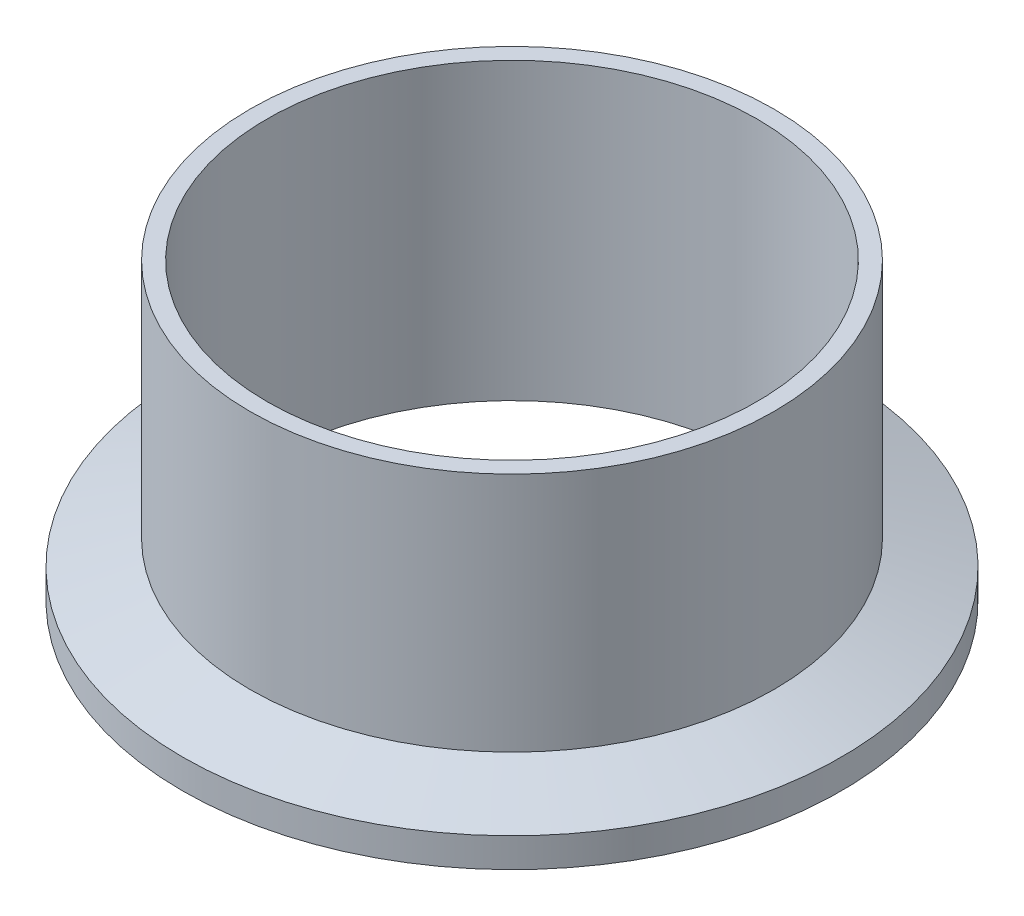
ISO-10303-21;
HEADER;
FILE_DESCRIPTION(('STEP AP214'),'2;1');
FILE_NAME('part.step','',(''),(''),'','','');
FILE_SCHEMA(('AUTOMOTIVE_DESIGN { 1 0 10303 214 1 1 1 1 }'));
ENDSEC;
DATA;
#1=APPLICATION_CONTEXT('core data for automotive mechanical design processes');
#2=APPLICATION_PROTOCOL_DEFINITION('international standard','automotive_design',2000,#1);
#3=PRODUCT_CONTEXT('',#1,'mechanical');
#4=PRODUCT('Part','Part','',(#3));
#5=PRODUCT_RELATED_PRODUCT_CATEGORY('part','',(#4));
#6=PRODUCT_DEFINITION_FORMATION('','',#4);
#7=PRODUCT_DEFINITION_CONTEXT('part definition',#1,'design');
#8=PRODUCT_DEFINITION('design','',#6,#7);
#9=PRODUCT_DEFINITION_SHAPE('','',#8);
#10=(LENGTH_UNIT() NAMED_UNIT(*) SI_UNIT(.MILLI.,.METRE.));
#11=(NAMED_UNIT(*) PLANE_ANGLE_UNIT() SI_UNIT($,.RADIAN.));
#12=(NAMED_UNIT(*) SI_UNIT($,.STERADIAN.) SOLID_ANGLE_UNIT());
#13=UNCERTAINTY_MEASURE_WITH_UNIT(LENGTH_MEASURE(1.E-05),#10,'distance_accuracy_value','');
#14=(GEOMETRIC_REPRESENTATION_CONTEXT(3) GLOBAL_UNCERTAINTY_ASSIGNED_CONTEXT((#13)) GLOBAL_UNIT_ASSIGNED_CONTEXT((#10,
#11,#12)) REPRESENTATION_CONTEXT('',''));
#15=CARTESIAN_POINT('',(0.,0.,0.));
#16=DIRECTION('',(0.,0.,1.));
#17=DIRECTION('',(1.,0.,0.));
#18=AXIS2_PLACEMENT_3D('',#15,#16,#17);
#19=CARTESIAN_POINT('',(0.,0.787399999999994,0.));
#20=DIRECTION('',(0.,-1.,0.));
#21=DIRECTION('',(0.,0.,-1.));
#22=AXIS2_PLACEMENT_3D('',#19,#20,#21);
#23=TOROIDAL_SURFACE('',#22,29.9866084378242,0.787399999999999);
#24=CARTESIAN_POINT('',(0.,0.,0.));
#25=DIRECTION('',(0.,-1.,0.));
#26=DIRECTION('',(0.,0.,-1.));
#27=AXIS2_PLACEMENT_3D('',#24,#25,#26);
#28=CIRCLE('',#27,29.9866084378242);
#29=CARTESIAN_POINT('',(0.,0.,-29.9866084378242));
#30=VERTEX_POINT('',#29);
#31=EDGE_CURVE('E64',#30,#30,#28,.T.);
#32=ORIENTED_EDGE('',*,*,#31,.T.);
#33=EDGE_LOOP('',(#32));
#34=FACE_BOUND('',#33,.T.);
#35=CARTESIAN_POINT('',(0.,0.474458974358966,0.));
#36=DIRECTION('',(0.,-1.,0.));
#37=DIRECTION('',(0.,0.,-1.));
#38=AXIS2_PLACEMENT_3D('',#35,#36,#37);
#39=CIRCLE('',#38,29.2640666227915);
#40=CARTESIAN_POINT('',(0.,0.474458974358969,-29.2640666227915));
#41=VERTEX_POINT('',#40);
#42=EDGE_CURVE('E10',#41,#41,#39,.T.);
#43=ORIENTED_EDGE('',*,*,#42,.F.);
#44=EDGE_LOOP('',(#43));
#45=FACE_BOUND('',#44,.T.);
#46=ADVANCED_FACE('F30',(#34,#45),#23,.T.);
#47=CARTESIAN_POINT('',(0.,0.,0.));
#48=DIRECTION('',(0.,-1.,0.));
#49=DIRECTION('',(0.,0.,-1.));
#50=AXIS2_PLACEMENT_3D('',#47,#48,#49);
#51=TOROIDAL_SURFACE('',#50,28.1686,1.1938);
#52=CARTESIAN_POINT('',(0.,0.474458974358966,0.));
#53=DIRECTION('',(0.,-1.,0.));
#54=DIRECTION('',(0.,0.,-1.));
#55=AXIS2_PLACEMENT_3D('',#52,#53,#54);
#56=CIRCLE('',#55,27.0731333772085);
#57=CARTESIAN_POINT('',(0.,0.474458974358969,-27.0731333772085));
#58=VERTEX_POINT('',#57);
#59=EDGE_CURVE('E36',#58,#58,#56,.T.);
#60=ORIENTED_EDGE('',*,*,#59,.F.);
#61=EDGE_LOOP('',(#60));
#62=FACE_BOUND('',#61,.T.);
#63=ORIENTED_EDGE('',*,*,#42,.T.);
#64=EDGE_LOOP('',(#63));
#65=FACE_BOUND('',#64,.T.);
#66=ADVANCED_FACE('F112',(#62,#65),#51,.F.);
#67=CARTESIAN_POINT('',(0.,0.787399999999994,0.));
#68=DIRECTION('',(0.,-1.,0.));
#69=DIRECTION('',(0.,0.,-1.));
#70=AXIS2_PLACEMENT_3D('',#67,#68,#69);
#71=TOROIDAL_SURFACE('',#70,26.3505915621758,0.787399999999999);
#72=ORIENTED_EDGE('',*,*,#59,.T.);
#73=EDGE_LOOP('',(#72));
#74=FACE_BOUND('',#73,.T.);
#75=CARTESIAN_POINT('',(0.,0.,0.));
#76=DIRECTION('',(0.,-1.,0.));
#77=DIRECTION('',(0.,0.,-1.));
#78=AXIS2_PLACEMENT_3D('',#75,#76,#77);
#79=CIRCLE('',#78,26.3505915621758);
#80=CARTESIAN_POINT('',(0.,0.,-26.3505915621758));
#81=VERTEX_POINT('',#80);
#82=EDGE_CURVE('E40',#81,#81,#79,.T.);
#83=ORIENTED_EDGE('',*,*,#82,.F.);
#84=EDGE_LOOP('',(#83));
#85=FACE_BOUND('',#84,.T.);
#86=ADVANCED_FACE('F108',(#74,#85),#71,.T.);
#87=CARTESIAN_POINT('',(0.,0.,0.));
#88=DIRECTION('',(0.,1.,0.));
#89=DIRECTION('',(0.,0.,1.));
#90=AXIS2_PLACEMENT_3D('',#87,#88,#89);
#91=PLANE('',#90);
#92=CARTESIAN_POINT('',(0.,0.,0.));
#93=DIRECTION('',(0.,-1.,0.));
#94=DIRECTION('',(0.,0.,-1.));
#95=AXIS2_PLACEMENT_3D('',#92,#93,#94);
#96=CIRCLE('',#95,23.749);
#97=CARTESIAN_POINT('',(0.,0.,-23.749));
#98=VERTEX_POINT('',#97);
#99=EDGE_CURVE('E44',#98,#98,#96,.T.);
#100=ORIENTED_EDGE('',*,*,#99,.F.);
#101=EDGE_LOOP('',(#100));
#102=FACE_BOUND('',#101,.T.);
#103=ORIENTED_EDGE('',*,*,#82,.T.);
#104=EDGE_LOOP('',(#103));
#105=FACE_BOUND('',#104,.T.);
#106=ADVANCED_FACE('F102',(#102,#105),#91,.F.);
#107=CARTESIAN_POINT('',(0.,0.,0.));
#108=DIRECTION('',(0.,-1.,0.));
#109=DIRECTION('',(0.,0.,-1.));
#110=AXIS2_PLACEMENT_3D('',#107,#108,#109);
#111=CYLINDRICAL_SURFACE('',#110,23.749);
#112=ORIENTED_EDGE('',*,*,#99,.T.);
#113=EDGE_LOOP('',(#112));
#114=FACE_BOUND('',#113,.T.);
#115=CARTESIAN_POINT('',(0.,28.575,0.));
#116=DIRECTION('',(0.,-1.,0.));
#117=DIRECTION('',(0.,0.,-1.));
#118=AXIS2_PLACEMENT_3D('',#115,#116,#117);
#119=CIRCLE('',#118,23.749);
#120=CARTESIAN_POINT('',(0.,28.575,-23.749));
#121=VERTEX_POINT('',#120);
#122=EDGE_CURVE('E49',#121,#121,#119,.T.);
#123=ORIENTED_EDGE('',*,*,#122,.F.);
#124=EDGE_LOOP('',(#123));
#125=FACE_BOUND('',#124,.T.);
#126=ADVANCED_FACE('F97',(#114,#125),#111,.F.);
#127=CARTESIAN_POINT('',(0.,28.575,0.));
#128=DIRECTION('',(0.,-1.,0.));
#129=DIRECTION('',(0.,0.,-1.));
#130=AXIS2_PLACEMENT_3D('',#127,#128,#129);
#131=PLANE('',#130);
#132=CARTESIAN_POINT('',(0.,28.575,0.));
#133=DIRECTION('',(0.,-1.,0.));
#134=DIRECTION('',(0.,0.,-1.));
#135=AXIS2_PLACEMENT_3D('',#132,#133,#134);
#136=CIRCLE('',#135,25.4);
#137=CARTESIAN_POINT('',(0.,28.575,-25.4));
#138=VERTEX_POINT('',#137);
#139=EDGE_CURVE('E52',#138,#138,#136,.T.);
#140=ORIENTED_EDGE('',*,*,#139,.F.);
#141=EDGE_LOOP('',(#140));
#142=FACE_BOUND('',#141,.T.);
#143=ORIENTED_EDGE('',*,*,#122,.T.);
#144=EDGE_LOOP('',(#143));
#145=FACE_BOUND('',#144,.T.);
#146=ADVANCED_FACE('F91',(#142,#145),#131,.F.);
#147=CARTESIAN_POINT('',(0.,0.,0.));
#148=DIRECTION('',(0.,-1.,0.));
#149=DIRECTION('',(0.,0.,-1.));
#150=AXIS2_PLACEMENT_3D('',#147,#148,#149);
#151=CYLINDRICAL_SURFACE('',#150,25.4);
#152=CARTESIAN_POINT('',(0.,5.22996973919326,0.));
#153=DIRECTION('',(0.,-1.,0.));
#154=DIRECTION('',(0.,0.,-1.));
#155=AXIS2_PLACEMENT_3D('',#152,#153,#154);
#156=CIRCLE('',#155,25.4);
#157=CARTESIAN_POINT('',(0.,5.22996973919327,-25.4));
#158=VERTEX_POINT('',#157);
#159=EDGE_CURVE('E55',#158,#158,#156,.T.);
#160=ORIENTED_EDGE('',*,*,#159,.F.);
#161=EDGE_LOOP('',(#160));
#162=FACE_BOUND('',#161,.T.);
#163=ORIENTED_EDGE('',*,*,#139,.T.);
#164=EDGE_LOOP('',(#163));
#165=FACE_BOUND('',#164,.T.);
#166=ADVANCED_FACE('F85',(#162,#165),#151,.T.);
#167=CARTESIAN_POINT('',(0.,5.22996973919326,0.));
#168=DIRECTION('',(0.,-1.,0.));
#169=DIRECTION('',(0.,0.,-1.));
#170=AXIS2_PLACEMENT_3D('',#167,#168,#169);
#171=CONICAL_SURFACE('',#170,25.4,1.22173047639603);
#172=CARTESIAN_POINT('',(0.,2.84480000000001,0.));
#173=DIRECTION('',(0.,-1.,0.));
#174=DIRECTION('',(0.,0.,-1.));
#175=AXIS2_PLACEMENT_3D('',#172,#173,#174);
#176=CIRCLE('',#175,31.9532);
#177=CARTESIAN_POINT('',(0.,2.84480000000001,-31.9532));
#178=VERTEX_POINT('',#177);
#179=EDGE_CURVE('E58',#178,#178,#176,.T.);
#180=ORIENTED_EDGE('',*,*,#179,.F.);
#181=EDGE_LOOP('',(#180));
#182=FACE_BOUND('',#181,.T.);
#183=ORIENTED_EDGE('',*,*,#159,.T.);
#184=EDGE_LOOP('',(#183));
#185=FACE_BOUND('',#184,.T.);
#186=ADVANCED_FACE('F79',(#182,#185),#171,.T.);
#187=CARTESIAN_POINT('',(0.,0.,0.));
#188=DIRECTION('',(0.,-1.,0.));
#189=DIRECTION('',(0.,0.,-1.));
#190=AXIS2_PLACEMENT_3D('',#187,#188,#189);
#191=CYLINDRICAL_SURFACE('',#190,31.9532);
#192=CARTESIAN_POINT('',(0.,0.,0.));
#193=DIRECTION('',(0.,-1.,0.));
#194=DIRECTION('',(0.,0.,-1.));
#195=AXIS2_PLACEMENT_3D('',#192,#193,#194);
#196=CIRCLE('',#195,31.9532);
#197=CARTESIAN_POINT('',(0.,0.,-31.9532));
#198=VERTEX_POINT('',#197);
#199=EDGE_CURVE('E61',#198,#198,#196,.T.);
#200=ORIENTED_EDGE('',*,*,#199,.F.);
#201=EDGE_LOOP('',(#200));
#202=FACE_BOUND('',#201,.T.);
#203=ORIENTED_EDGE('',*,*,#179,.T.);
#204=EDGE_LOOP('',(#203));
#205=FACE_BOUND('',#204,.T.);
#206=ADVANCED_FACE('F73',(#202,#205),#191,.T.);
#207=CARTESIAN_POINT('',(0.,0.,0.));
#208=DIRECTION('',(0.,1.,0.));
#209=DIRECTION('',(0.,0.,1.));
#210=AXIS2_PLACEMENT_3D('',#207,#208,#209);
#211=PLANE('',#210);
#212=ORIENTED_EDGE('',*,*,#31,.F.);
#213=EDGE_LOOP('',(#212));
#214=FACE_BOUND('',#213,.T.);
#215=ORIENTED_EDGE('',*,*,#199,.T.);
#216=EDGE_LOOP('',(#215));
#217=FACE_BOUND('',#216,.T.);
#218=ADVANCED_FACE('F70',(#214,#217),#211,.F.);
#219=CLOSED_SHELL('',(#46,#66,#86,#106,#126,#146,#166,#186,#206,#218));
#220=MANIFOLD_SOLID_BREP('B2',#219);
#221=ADVANCED_BREP_SHAPE_REPRESENTATION('',(#18,#220),#14);
#222=SHAPE_DEFINITION_REPRESENTATION(#9,#221);
ENDSEC;
END-ISO-10303-21;
